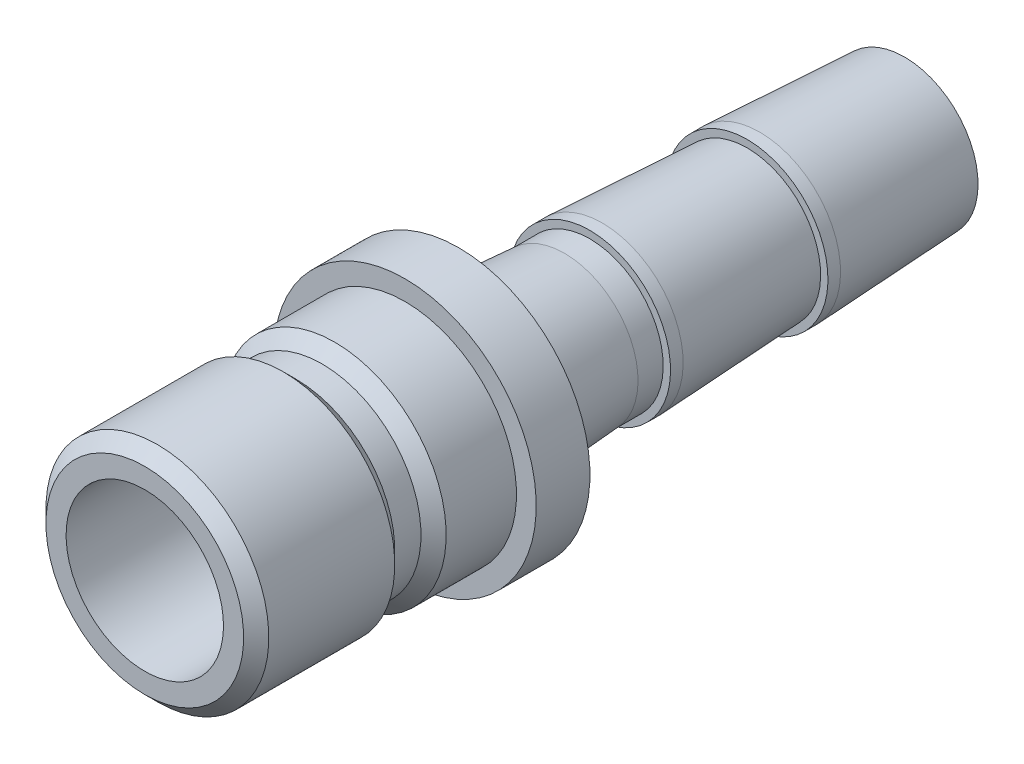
from build123d import *


with BuildPart() as part:
    # Sketch1 → Revolve1 (revolve)
    with BuildSketch(Plane(origin=(0, 0, 0), x_dir=(0, 0, -1), z_dir=(1, 0, 0))):
        Polygon((-15.748, 4.7625), (-15.748, 5.9817), (-14.986, 6.7437), (-7.366, 6.7437), (-6.604, 5.9817), (-5.0165, 5.9817), (-4.2545, 6.7437), (0, 6.7437), (0, 7.9375), (3.2512, 7.9375), (3.2512, 4.8895), (9.652, 4.445), (11.176, 4.445), (11.176, 4.8895), (11.938, 4.8895), (20.701, 4.445), (20.701, 4.8895), (21.463, 4.8895), (30.226, 4.445), (30.226, 3.571875), (-0.691870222, 3.571875), (-3.556, 4.7625), align=None)
    revolve(axis=Axis((0, 0, 0), (0, 0, 1)))


solid = part.part
